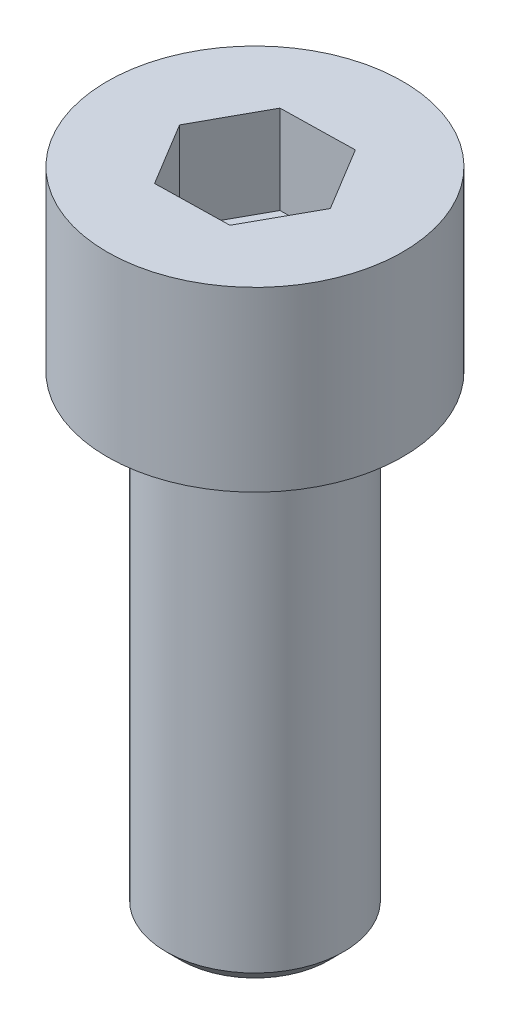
ISO-10303-21;
HEADER;
FILE_DESCRIPTION(('STEP AP214'),'2;1');
FILE_NAME('part.step','',(''),(''),'','','');
FILE_SCHEMA(('AUTOMOTIVE_DESIGN { 1 0 10303 214 1 1 1 1 }'));
ENDSEC;
DATA;
#1=APPLICATION_CONTEXT('core data for automotive mechanical design processes');
#2=APPLICATION_PROTOCOL_DEFINITION('international standard','automotive_design',2000,#1);
#3=PRODUCT_CONTEXT('',#1,'mechanical');
#4=PRODUCT('Part','Part','',(#3));
#5=PRODUCT_RELATED_PRODUCT_CATEGORY('part','',(#4));
#6=PRODUCT_DEFINITION_FORMATION('','',#4);
#7=PRODUCT_DEFINITION_CONTEXT('part definition',#1,'design');
#8=PRODUCT_DEFINITION('design','',#6,#7);
#9=PRODUCT_DEFINITION_SHAPE('','',#8);
#10=(LENGTH_UNIT() NAMED_UNIT(*) SI_UNIT(.MILLI.,.METRE.));
#11=(NAMED_UNIT(*) PLANE_ANGLE_UNIT() SI_UNIT($,.RADIAN.));
#12=(NAMED_UNIT(*) SI_UNIT($,.STERADIAN.) SOLID_ANGLE_UNIT());
#13=UNCERTAINTY_MEASURE_WITH_UNIT(LENGTH_MEASURE(1.E-05),#10,'distance_accuracy_value','');
#14=(GEOMETRIC_REPRESENTATION_CONTEXT(3) GLOBAL_UNCERTAINTY_ASSIGNED_CONTEXT((#13)) GLOBAL_UNIT_ASSIGNED_CONTEXT((#10,
#11,#12)) REPRESENTATION_CONTEXT('',''));
#15=CARTESIAN_POINT('',(0.,0.,0.));
#16=DIRECTION('',(0.,0.,1.));
#17=DIRECTION('',(1.,0.,0.));
#18=AXIS2_PLACEMENT_3D('',#15,#16,#17);
#19=CARTESIAN_POINT('',(0.,7.54618173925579,0.));
#20=DIRECTION('',(0.,1.,0.));
#21=DIRECTION('',(0.,0.,1.));
#22=AXIS2_PLACEMENT_3D('',#19,#20,#21);
#23=CYLINDRICAL_SURFACE('',#22,3.00000000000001);
#24=CARTESIAN_POINT('',(0.,0.,0.));
#25=DIRECTION('',(0.,1.,0.));
#26=DIRECTION('',(0.,0.,1.));
#27=AXIS2_PLACEMENT_3D('',#24,#25,#26);
#28=CIRCLE('',#27,3.00000000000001);
#29=CARTESIAN_POINT('',(0.,0.,3.00000000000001));
#30=VERTEX_POINT('',#29);
#31=EDGE_CURVE('E128',#30,#30,#28,.T.);
#32=CARTESIAN_POINT('',(0.,-15.5,0.));
#33=DIRECTION('',(0.,1.,0.));
#34=DIRECTION('',(0.,0.,1.));
#35=AXIS2_PLACEMENT_3D('',#32,#33,#34);
#36=CIRCLE('',#35,3.00000000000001);
#37=CARTESIAN_POINT('',(0.,-15.5,3.00000000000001));
#38=VERTEX_POINT('',#37);
#39=EDGE_CURVE('E11',#38,#38,#36,.T.);
#40=CARTESIAN_POINT('',(0.,0.,3.00000000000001));
#41=CARTESIAN_POINT('',(0.,-0.161458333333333,3.00000000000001));
#42=CARTESIAN_POINT('',(0.,-0.322916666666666,3.00000000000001));
#43=CARTESIAN_POINT('',(0.,-0.645833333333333,3.00000000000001));
#44=CARTESIAN_POINT('',(0.,-0.807291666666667,3.00000000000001));
#45=CARTESIAN_POINT('',(0.,-1.13020833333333,3.00000000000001));
#46=CARTESIAN_POINT('',(0.,-1.29166666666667,3.00000000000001));
#47=CARTESIAN_POINT('',(0.,-1.61458333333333,3.00000000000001));
#48=CARTESIAN_POINT('',(0.,-1.77604166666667,3.00000000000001));
#49=CARTESIAN_POINT('',(0.,-2.09895833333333,3.00000000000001));
#50=CARTESIAN_POINT('',(0.,-2.26041666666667,3.00000000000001));
#51=CARTESIAN_POINT('',(0.,-2.58333333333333,3.00000000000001));
#52=CARTESIAN_POINT('',(0.,-2.74479166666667,3.00000000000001));
#53=CARTESIAN_POINT('',(0.,-3.06770833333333,3.00000000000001));
#54=CARTESIAN_POINT('',(0.,-3.22916666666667,3.00000000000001));
#55=CARTESIAN_POINT('',(0.,-3.55208333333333,3.00000000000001));
#56=CARTESIAN_POINT('',(0.,-3.71354166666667,3.00000000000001));
#57=CARTESIAN_POINT('',(0.,-4.03645833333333,3.00000000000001));
#58=CARTESIAN_POINT('',(0.,-4.19791666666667,3.00000000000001));
#59=CARTESIAN_POINT('',(0.,-4.52083333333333,3.00000000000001));
#60=CARTESIAN_POINT('',(0.,-4.68229166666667,3.00000000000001));
#61=CARTESIAN_POINT('',(0.,-5.00520833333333,3.00000000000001));
#62=CARTESIAN_POINT('',(0.,-5.16666666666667,3.00000000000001));
#63=CARTESIAN_POINT('',(0.,-5.48958333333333,3.00000000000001));
#64=CARTESIAN_POINT('',(0.,-5.65104166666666,3.00000000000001));
#65=CARTESIAN_POINT('',(0.,-5.97395833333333,3.00000000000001));
#66=CARTESIAN_POINT('',(0.,-6.13541666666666,3.00000000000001));
#67=CARTESIAN_POINT('',(0.,-6.45833333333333,3.00000000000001));
#68=CARTESIAN_POINT('',(0.,-6.61979166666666,3.00000000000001));
#69=CARTESIAN_POINT('',(0.,-6.94270833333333,3.00000000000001));
#70=CARTESIAN_POINT('',(0.,-7.10416666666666,3.00000000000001));
#71=CARTESIAN_POINT('',(0.,-7.42708333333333,3.00000000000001));
#72=CARTESIAN_POINT('',(0.,-7.58854166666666,3.00000000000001));
#73=CARTESIAN_POINT('',(0.,-7.91145833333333,3.00000000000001));
#74=CARTESIAN_POINT('',(0.,-8.07291666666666,3.00000000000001));
#75=CARTESIAN_POINT('',(0.,-8.39583333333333,3.00000000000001));
#76=CARTESIAN_POINT('',(0.,-8.55729166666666,3.00000000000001));
#77=CARTESIAN_POINT('',(0.,-8.88020833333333,3.00000000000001));
#78=CARTESIAN_POINT('',(0.,-9.04166666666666,3.00000000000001));
#79=CARTESIAN_POINT('',(0.,-9.36458333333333,3.00000000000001));
#80=CARTESIAN_POINT('',(0.,-9.52604166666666,3.00000000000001));
#81=CARTESIAN_POINT('',(0.,-9.84895833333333,3.00000000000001));
#82=CARTESIAN_POINT('',(0.,-10.0104166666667,3.00000000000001));
#83=CARTESIAN_POINT('',(0.,-10.3333333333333,3.00000000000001));
#84=CARTESIAN_POINT('',(0.,-10.4947916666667,3.00000000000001));
#85=CARTESIAN_POINT('',(0.,-10.8177083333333,3.00000000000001));
#86=CARTESIAN_POINT('',(0.,-10.9791666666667,3.00000000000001));
#87=CARTESIAN_POINT('',(0.,-11.3020833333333,3.00000000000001));
#88=CARTESIAN_POINT('',(0.,-11.4635416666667,3.00000000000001));
#89=CARTESIAN_POINT('',(0.,-11.7864583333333,3.00000000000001));
#90=CARTESIAN_POINT('',(0.,-11.9479166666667,3.00000000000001));
#91=CARTESIAN_POINT('',(0.,-12.2708333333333,3.00000000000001));
#92=CARTESIAN_POINT('',(0.,-12.4322916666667,3.00000000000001));
#93=CARTESIAN_POINT('',(0.,-12.7552083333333,3.00000000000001));
#94=CARTESIAN_POINT('',(0.,-12.9166666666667,3.00000000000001));
#95=CARTESIAN_POINT('',(0.,-13.2395833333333,3.00000000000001));
#96=CARTESIAN_POINT('',(0.,-13.4010416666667,3.00000000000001));
#97=CARTESIAN_POINT('',(0.,-13.7239583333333,3.00000000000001));
#98=CARTESIAN_POINT('',(0.,-13.8854166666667,3.00000000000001));
#99=CARTESIAN_POINT('',(0.,-14.2083333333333,3.00000000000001));
#100=CARTESIAN_POINT('',(0.,-14.3697916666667,3.00000000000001));
#101=CARTESIAN_POINT('',(0.,-14.6927083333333,3.00000000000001));
#102=CARTESIAN_POINT('',(0.,-14.8541666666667,3.00000000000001));
#103=CARTESIAN_POINT('',(0.,-15.1770833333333,3.00000000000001));
#104=CARTESIAN_POINT('',(0.,-15.3385416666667,3.00000000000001));
#105=CARTESIAN_POINT('',(0.,-15.5,3.00000000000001));
#106=B_SPLINE_CURVE_WITH_KNOTS('',3,(#40,#41,#42,#43,#44,#45,#46,#47,#48,#49,#50,#51,#52,#53,
#54,#55,#56,#57,#58,#59,#60,#61,#62,#63,#64,#65,#66,#67,#68,#69,#70,#71,#72,#73,#74,#75,#76,#77,
#78,#79,#80,#81,#82,#83,#84,#85,#86,#87,#88,#89,#90,#91,#92,#93,#94,#95,#96,#97,#98,#99,#100,
#101,#102,#103,#104,#105),.UNSPECIFIED.,.F.,.F.,(4,2,2,2,2,2,2,2,2,2,2,2,2,2,2,2,2,2,2,2,2,2,2,
2,2,2,2,2,2,2,2,2,4),(0.,0.484375,0.96875,1.453125,1.9375,2.421875,2.90625,3.390625,3.875,
4.359375,4.84375,5.328125,5.8125,6.296875,6.78125,7.265625,7.75,8.234375,8.71875,9.203125,
9.6875,10.171875,10.65625,11.140625,11.625,12.109375,12.59375,13.078125,13.5625,14.046875,
14.53125,15.015625,15.5),.UNSPECIFIED.);
#107=EDGE_CURVE('BSEAM26',#30,#38,#106,.T.);
#108=ORIENTED_EDGE('',*,*,#31,.F.);
#109=ORIENTED_EDGE('',*,*,#39,.T.);
#110=ORIENTED_EDGE('',*,*,#107,.T.);
#111=ORIENTED_EDGE('',*,*,#107,.F.);
#112=EDGE_LOOP('',(#108,#110,#109,#111));
#113=FACE_BOUND('',#112,.T.);
#114=ADVANCED_FACE('F26',(#113),#23,.T.);
#115=CARTESIAN_POINT('',(0.,-16.,0.));
#116=DIRECTION('',(0.,1.,0.));
#117=DIRECTION('',(0.,0.,1.));
#118=AXIS2_PLACEMENT_3D('',#115,#116,#117);
#119=CONICAL_SURFACE('',#118,2.50000000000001,0.785398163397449);
#120=CARTESIAN_POINT('',(0.,-16.,0.));
#121=DIRECTION('',(0.,1.,0.));
#122=DIRECTION('',(0.,0.,1.));
#123=AXIS2_PLACEMENT_3D('',#120,#121,#122);
#124=CIRCLE('',#123,2.50000000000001);
#125=CARTESIAN_POINT('',(0.,-16.,2.5));
#126=VERTEX_POINT('',#125);
#127=EDGE_CURVE('E33',#126,#126,#124,.T.);
#128=CARTESIAN_POINT('',(0.,-15.5,3.));
#129=CARTESIAN_POINT('',(0.,-15.5052083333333,2.99479166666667));
#130=CARTESIAN_POINT('',(0.,-15.5104166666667,2.98958333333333));
#131=CARTESIAN_POINT('',(0.,-15.5208333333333,2.97916666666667));
#132=CARTESIAN_POINT('',(0.,-15.5260416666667,2.97395833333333));
#133=CARTESIAN_POINT('',(0.,-15.5364583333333,2.96354166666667));
#134=CARTESIAN_POINT('',(0.,-15.5416666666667,2.95833333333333));
#135=CARTESIAN_POINT('',(0.,-15.5520833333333,2.94791666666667));
#136=CARTESIAN_POINT('',(0.,-15.5572916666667,2.94270833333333));
#137=CARTESIAN_POINT('',(0.,-15.5677083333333,2.93229166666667));
#138=CARTESIAN_POINT('',(0.,-15.5729166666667,2.92708333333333));
#139=CARTESIAN_POINT('',(0.,-15.5833333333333,2.91666666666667));
#140=CARTESIAN_POINT('',(0.,-15.5885416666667,2.91145833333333));
#141=CARTESIAN_POINT('',(0.,-15.5989583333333,2.90104166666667));
#142=CARTESIAN_POINT('',(0.,-15.6041666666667,2.89583333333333));
#143=CARTESIAN_POINT('',(0.,-15.6145833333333,2.88541666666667));
#144=CARTESIAN_POINT('',(0.,-15.6197916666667,2.88020833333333));
#145=CARTESIAN_POINT('',(0.,-15.6302083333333,2.86979166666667));
#146=CARTESIAN_POINT('',(0.,-15.6354166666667,2.86458333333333));
#147=CARTESIAN_POINT('',(0.,-15.6458333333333,2.85416666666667));
#148=CARTESIAN_POINT('',(0.,-15.6510416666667,2.84895833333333));
#149=CARTESIAN_POINT('',(0.,-15.6614583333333,2.83854166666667));
#150=CARTESIAN_POINT('',(0.,-15.6666666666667,2.83333333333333));
#151=CARTESIAN_POINT('',(0.,-15.6770833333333,2.82291666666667));
#152=CARTESIAN_POINT('',(0.,-15.6822916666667,2.81770833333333));
#153=CARTESIAN_POINT('',(0.,-15.6927083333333,2.80729166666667));
#154=CARTESIAN_POINT('',(0.,-15.6979166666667,2.80208333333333));
#155=CARTESIAN_POINT('',(0.,-15.7083333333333,2.79166666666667));
#156=CARTESIAN_POINT('',(0.,-15.7135416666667,2.78645833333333));
#157=CARTESIAN_POINT('',(0.,-15.7239583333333,2.77604166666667));
#158=CARTESIAN_POINT('',(0.,-15.7291666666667,2.77083333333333));
#159=CARTESIAN_POINT('',(0.,-15.7395833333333,2.76041666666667));
#160=CARTESIAN_POINT('',(0.,-15.7447916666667,2.75520833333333));
#161=CARTESIAN_POINT('',(0.,-15.7552083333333,2.74479166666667));
#162=CARTESIAN_POINT('',(0.,-15.7604166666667,2.73958333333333));
#163=CARTESIAN_POINT('',(0.,-15.7708333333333,2.72916666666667));
#164=CARTESIAN_POINT('',(0.,-15.7760416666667,2.72395833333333));
#165=CARTESIAN_POINT('',(0.,-15.7864583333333,2.71354166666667));
#166=CARTESIAN_POINT('',(0.,-15.7916666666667,2.70833333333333));
#167=CARTESIAN_POINT('',(0.,-15.8020833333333,2.69791666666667));
#168=CARTESIAN_POINT('',(0.,-15.8072916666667,2.69270833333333));
#169=CARTESIAN_POINT('',(0.,-15.8177083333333,2.68229166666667));
#170=CARTESIAN_POINT('',(0.,-15.8229166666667,2.67708333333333));
#171=CARTESIAN_POINT('',(0.,-15.8333333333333,2.66666666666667));
#172=CARTESIAN_POINT('',(0.,-15.8385416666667,2.66145833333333));
#173=CARTESIAN_POINT('',(0.,-15.8489583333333,2.65104166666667));
#174=CARTESIAN_POINT('',(0.,-15.8541666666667,2.64583333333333));
#175=CARTESIAN_POINT('',(0.,-15.8645833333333,2.63541666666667));
#176=CARTESIAN_POINT('',(0.,-15.8697916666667,2.63020833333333));
#177=CARTESIAN_POINT('',(0.,-15.8802083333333,2.61979166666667));
#178=CARTESIAN_POINT('',(0.,-15.8854166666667,2.61458333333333));
#179=CARTESIAN_POINT('',(0.,-15.8958333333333,2.60416666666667));
#180=CARTESIAN_POINT('',(0.,-15.9010416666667,2.59895833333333));
#181=CARTESIAN_POINT('',(0.,-15.9114583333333,2.58854166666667));
#182=CARTESIAN_POINT('',(0.,-15.9166666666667,2.58333333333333));
#183=CARTESIAN_POINT('',(0.,-15.9270833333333,2.57291666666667));
#184=CARTESIAN_POINT('',(0.,-15.9322916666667,2.56770833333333));
#185=CARTESIAN_POINT('',(0.,-15.9427083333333,2.55729166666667));
#186=CARTESIAN_POINT('',(0.,-15.9479166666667,2.55208333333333));
#187=CARTESIAN_POINT('',(0.,-15.9583333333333,2.54166666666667));
#188=CARTESIAN_POINT('',(0.,-15.9635416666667,2.53645833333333));
#189=CARTESIAN_POINT('',(0.,-15.9739583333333,2.52604166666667));
#190=CARTESIAN_POINT('',(0.,-15.9791666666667,2.52083333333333));
#191=CARTESIAN_POINT('',(0.,-15.9895833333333,2.51041666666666));
#192=CARTESIAN_POINT('',(0.,-15.9947916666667,2.50520833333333));
#193=CARTESIAN_POINT('',(0.,-16.,2.5));
#194=B_SPLINE_CURVE_WITH_KNOTS('',3,(#128,#129,#130,#131,#132,#133,#134,#135,#136,#137,#138,
#139,#140,#141,#142,#143,#144,#145,#146,#147,#148,#149,#150,#151,#152,#153,#154,#155,#156,#157,
#158,#159,#160,#161,#162,#163,#164,#165,#166,#167,#168,#169,#170,#171,#172,#173,#174,#175,#176,
#177,#178,#179,#180,#181,#182,#183,#184,#185,#186,#187,#188,#189,#190,#191,#192,#193),
.UNSPECIFIED.,.F.,.F.,(4,2,2,2,2,2,2,2,2,2,2,2,2,2,2,2,2,2,2,2,2,2,2,2,2,2,2,2,2,2,2,2,4),(0.,
0.0220970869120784,0.044194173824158,0.0662912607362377,0.0883883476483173,0.110485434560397,
0.132582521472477,0.154679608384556,0.176776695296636,0.198873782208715,0.220970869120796,
0.243067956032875,0.265165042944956,0.287262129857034,0.309359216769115,0.331456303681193,
0.353553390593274,0.375650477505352,0.397747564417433,0.419844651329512,0.441941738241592,
0.464038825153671,0.486135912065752,0.50823299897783,0.530330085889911,0.552427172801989,
0.57452425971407,0.596621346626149,0.61871843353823,0.640815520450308,0.662912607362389,
0.685009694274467,0.707106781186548),.UNSPECIFIED.);
#195=EDGE_CURVE('BSEAM145',#38,#126,#194,.T.);
#196=ORIENTED_EDGE('',*,*,#39,.F.);
#197=ORIENTED_EDGE('',*,*,#127,.T.);
#198=ORIENTED_EDGE('',*,*,#195,.T.);
#199=ORIENTED_EDGE('',*,*,#195,.F.);
#200=EDGE_LOOP('',(#196,#198,#197,#199));
#201=FACE_BOUND('',#200,.T.);
#202=ADVANCED_FACE('F145',(#201),#119,.T.);
#203=CARTESIAN_POINT('',(0.,-16.,0.));
#204=DIRECTION('',(0.,1.,0.));
#205=DIRECTION('',(0.,0.,1.));
#206=AXIS2_PLACEMENT_3D('',#203,#204,#205);
#207=PLANE('',#206);
#208=ORIENTED_EDGE('',*,*,#127,.F.);
#209=EDGE_LOOP('',(#208));
#210=FACE_BOUND('',#209,.T.);
#211=ADVANCED_FACE('F147',(#210),#207,.F.);
#212=CARTESIAN_POINT('',(4.99999999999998,6.,0.));
#213=DIRECTION('',(0.,-1.,0.));
#214=DIRECTION('',(0.,0.,-1.));
#215=AXIS2_PLACEMENT_3D('',#212,#213,#214);
#216=PLANE('',#215);
#217=DIRECTION('',(0.517275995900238,0.,0.855818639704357));
#218=VECTOR('',#217,1.);
#219=CARTESIAN_POINT('',(-2.49949670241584,5.99999999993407,0.0501620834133));
#220=LINE('',#219,#218);
#221=CARTESIAN_POINT('',(-2.49949670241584,6.00000000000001,0.0501620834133));
#222=VERTEX_POINT('',#221);
#223=CARTESIAN_POINT('',(-1.20630671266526,5.99999999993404,2.18970868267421));
#224=VERTEX_POINT('',#223);
#225=EDGE_CURVE('E94',#222,#224,#220,.T.);
#226=ORIENTED_EDGE('',*,*,#225,.F.);
#227=DIRECTION('',(-0.482522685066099,0.,0.875883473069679));
#228=VECTOR('',#227,1.);
#229=CARTESIAN_POINT('',(-1.29318998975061,5.99999999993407,-2.13954659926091));
#230=LINE('',#229,#228);
#231=CARTESIAN_POINT('',(-1.29318998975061,5.99999999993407,-2.13954659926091));
#232=VERTEX_POINT('',#231);
#233=EDGE_CURVE('E40',#232,#222,#230,.T.);
#234=ORIENTED_EDGE('',*,*,#233,.F.);
#235=DIRECTION('',(-0.999798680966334,0.,0.0200648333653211));
#236=VECTOR('',#235,1.);
#237=CARTESIAN_POINT('',(1.20630671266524,5.99999999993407,-2.1897086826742));
#238=LINE('',#237,#236);
#239=CARTESIAN_POINT('',(1.20630671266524,5.99999999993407,-2.1897086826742));
#240=VERTEX_POINT('',#239);
#241=EDGE_CURVE('E110',#240,#232,#238,.T.);
#242=ORIENTED_EDGE('',*,*,#241,.F.);
#243=DIRECTION('',(-0.517275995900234,0.,-0.85581863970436));
#244=VECTOR('',#243,1.);
#245=CARTESIAN_POINT('',(2.49949670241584,5.99999999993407,-0.0501620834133));
#246=LINE('',#245,#244);
#247=CARTESIAN_POINT('',(2.49949670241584,5.99999999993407,-0.0501620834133));
#248=VERTEX_POINT('',#247);
#249=EDGE_CURVE('E104',#248,#240,#246,.T.);
#250=ORIENTED_EDGE('',*,*,#249,.F.);
#251=DIRECTION('',(0.482522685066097,0.,-0.875883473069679));
#252=VECTOR('',#251,1.);
#253=CARTESIAN_POINT('',(1.29318998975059,5.99999999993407,2.1395465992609));
#254=LINE('',#253,#252);
#255=CARTESIAN_POINT('',(1.29318998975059,5.99999999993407,2.1395465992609));
#256=VERTEX_POINT('',#255);
#257=EDGE_CURVE('E102',#256,#248,#254,.T.);
#258=ORIENTED_EDGE('',*,*,#257,.F.);
#259=DIRECTION('',(0.999798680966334,0.,-0.0200648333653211));
#260=VECTOR('',#259,1.);
#261=CARTESIAN_POINT('',(-1.20630671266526,5.99999999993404,2.18970868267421));
#262=LINE('',#261,#260);
#263=EDGE_CURVE('E83',#224,#256,#262,.T.);
#264=ORIENTED_EDGE('',*,*,#263,.F.);
#265=EDGE_LOOP('',(#226,#234,#242,#250,#258,#264));
#266=FACE_BOUND('',#265,.T.);
#267=CARTESIAN_POINT('',(0.,6.00000000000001,0.));
#268=DIRECTION('',(0.,1.,0.));
#269=DIRECTION('',(0.,0.,1.));
#270=AXIS2_PLACEMENT_3D('',#267,#268,#269);
#271=CIRCLE('',#270,5.);
#272=CARTESIAN_POINT('',(0.,6.00000000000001,5.));
#273=VERTEX_POINT('',#272);
#274=EDGE_CURVE('E140',#273,#273,#271,.T.);
#275=ORIENTED_EDGE('',*,*,#274,.T.);
#276=EDGE_LOOP('',(#275));
#277=FACE_BOUND('',#276,.T.);
#278=ADVANCED_FACE('F98',(#266,#277),#216,.F.);
#279=CARTESIAN_POINT('',(0.,7.54618173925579,0.));
#280=DIRECTION('',(0.,1.,0.));
#281=DIRECTION('',(0.,0.,1.));
#282=AXIS2_PLACEMENT_3D('',#279,#280,#281);
#283=CYLINDRICAL_SURFACE('',#282,5.);
#284=CARTESIAN_POINT('',(0.,0.,0.));
#285=DIRECTION('',(0.,1.,0.));
#286=DIRECTION('',(0.,0.,1.));
#287=AXIS2_PLACEMENT_3D('',#284,#285,#286);
#288=CIRCLE('',#287,5.);
#289=CARTESIAN_POINT('',(0.,0.,5.));
#290=VERTEX_POINT('',#289);
#291=EDGE_CURVE('E137',#290,#290,#288,.T.);
#292=CARTESIAN_POINT('',(0.,6.00000000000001,5.));
#293=CARTESIAN_POINT('',(0.,5.93750000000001,5.));
#294=CARTESIAN_POINT('',(0.,5.87500000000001,5.));
#295=CARTESIAN_POINT('',(0.,5.75000000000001,5.));
#296=CARTESIAN_POINT('',(0.,5.68750000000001,5.));
#297=CARTESIAN_POINT('',(0.,5.56250000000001,5.));
#298=CARTESIAN_POINT('',(0.,5.50000000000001,5.));
#299=CARTESIAN_POINT('',(0.,5.37500000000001,5.));
#300=CARTESIAN_POINT('',(0.,5.3125,5.));
#301=CARTESIAN_POINT('',(0.,5.1875,5.));
#302=CARTESIAN_POINT('',(0.,5.125,5.));
#303=CARTESIAN_POINT('',(0.,5.,5.));
#304=CARTESIAN_POINT('',(0.,4.9375,5.));
#305=CARTESIAN_POINT('',(0.,4.8125,5.));
#306=CARTESIAN_POINT('',(0.,4.75,5.));
#307=CARTESIAN_POINT('',(0.,4.625,5.));
#308=CARTESIAN_POINT('',(0.,4.5625,5.));
#309=CARTESIAN_POINT('',(0.,4.4375,5.));
#310=CARTESIAN_POINT('',(0.,4.375,5.));
#311=CARTESIAN_POINT('',(0.,4.25,5.));
#312=CARTESIAN_POINT('',(0.,4.1875,5.));
#313=CARTESIAN_POINT('',(0.,4.0625,5.));
#314=CARTESIAN_POINT('',(0.,4.,5.));
#315=CARTESIAN_POINT('',(0.,3.875,5.));
#316=CARTESIAN_POINT('',(0.,3.8125,5.));
#317=CARTESIAN_POINT('',(0.,3.6875,5.));
#318=CARTESIAN_POINT('',(0.,3.625,5.));
#319=CARTESIAN_POINT('',(0.,3.5,5.));
#320=CARTESIAN_POINT('',(0.,3.4375,5.));
#321=CARTESIAN_POINT('',(0.,3.3125,5.));
#322=CARTESIAN_POINT('',(0.,3.25,5.));
#323=CARTESIAN_POINT('',(0.,3.125,5.));
#324=CARTESIAN_POINT('',(0.,3.0625,5.));
#325=CARTESIAN_POINT('',(0.,2.9375,5.));
#326=CARTESIAN_POINT('',(0.,2.875,5.));
#327=CARTESIAN_POINT('',(0.,2.75,5.));
#328=CARTESIAN_POINT('',(0.,2.6875,5.));
#329=CARTESIAN_POINT('',(0.,2.5625,5.));
#330=CARTESIAN_POINT('',(0.,2.5,5.));
#331=CARTESIAN_POINT('',(0.,2.375,5.));
#332=CARTESIAN_POINT('',(0.,2.3125,5.));
#333=CARTESIAN_POINT('',(0.,2.1875,5.));
#334=CARTESIAN_POINT('',(0.,2.125,5.));
#335=CARTESIAN_POINT('',(0.,2.,5.));
#336=CARTESIAN_POINT('',(0.,1.9375,5.));
#337=CARTESIAN_POINT('',(0.,1.8125,5.));
#338=CARTESIAN_POINT('',(0.,1.75,5.));
#339=CARTESIAN_POINT('',(0.,1.625,5.));
#340=CARTESIAN_POINT('',(0.,1.5625,5.));
#341=CARTESIAN_POINT('',(0.,1.4375,5.));
#342=CARTESIAN_POINT('',(0.,1.375,5.));
#343=CARTESIAN_POINT('',(0.,1.25,5.));
#344=CARTESIAN_POINT('',(0.,1.1875,5.));
#345=CARTESIAN_POINT('',(0.,1.0625,5.));
#346=CARTESIAN_POINT('',(0.,1.,5.));
#347=CARTESIAN_POINT('',(0.,0.875000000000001,5.));
#348=CARTESIAN_POINT('',(0.,0.812500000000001,5.));
#349=CARTESIAN_POINT('',(0.,0.687500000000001,5.));
#350=CARTESIAN_POINT('',(0.,0.625000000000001,5.));
#351=CARTESIAN_POINT('',(0.,0.5,5.));
#352=CARTESIAN_POINT('',(0.,0.4375,5.));
#353=CARTESIAN_POINT('',(0.,0.3125,5.));
#354=CARTESIAN_POINT('',(0.,0.25,5.));
#355=CARTESIAN_POINT('',(0.,0.125,5.));
#356=CARTESIAN_POINT('',(0.,0.0625000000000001,5.));
#357=CARTESIAN_POINT('',(0.,0.,5.));
#358=B_SPLINE_CURVE_WITH_KNOTS('',3,(#292,#293,#294,#295,#296,#297,#298,#299,#300,#301,#302,
#303,#304,#305,#306,#307,#308,#309,#310,#311,#312,#313,#314,#315,#316,#317,#318,#319,#320,#321,
#322,#323,#324,#325,#326,#327,#328,#329,#330,#331,#332,#333,#334,#335,#336,#337,#338,#339,#340,
#341,#342,#343,#344,#345,#346,#347,#348,#349,#350,#351,#352,#353,#354,#355,#356,#357),
.UNSPECIFIED.,.F.,.F.,(4,2,2,2,2,2,2,2,2,2,2,2,2,2,2,2,2,2,2,2,2,2,2,2,2,2,2,2,2,2,2,2,4),(0.,
0.187499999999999,0.375,0.5625,0.750000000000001,0.937500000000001,1.125,1.3125,1.5,1.6875,
1.875,2.0625,2.25,2.4375,2.625,2.8125,3.,3.1875,3.375,3.5625,3.75,3.9375,4.125,4.3125,4.5,
4.6875,4.875,5.0625,5.25,5.4375,5.62500000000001,5.81250000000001,6.00000000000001),.UNSPECIFIED.);
#359=EDGE_CURVE('BSEAM154',#273,#290,#358,.T.);
#360=ORIENTED_EDGE('',*,*,#274,.F.);
#361=ORIENTED_EDGE('',*,*,#291,.T.);
#362=ORIENTED_EDGE('',*,*,#359,.T.);
#363=ORIENTED_EDGE('',*,*,#359,.F.);
#364=EDGE_LOOP('',(#360,#362,#361,#363));
#365=FACE_BOUND('',#364,.T.);
#366=ADVANCED_FACE('F154',(#365),#283,.T.);
#367=CARTESIAN_POINT('',(3.00000000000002,0.,0.));
#368=DIRECTION('',(0.,1.,0.));
#369=DIRECTION('',(0.,0.,1.));
#370=AXIS2_PLACEMENT_3D('',#367,#368,#369);
#371=PLANE('',#370);
#372=ORIENTED_EDGE('',*,*,#291,.F.);
#373=EDGE_LOOP('',(#372));
#374=FACE_BOUND('',#373,.T.);
#375=ORIENTED_EDGE('',*,*,#31,.T.);
#376=EDGE_LOOP('',(#375));
#377=FACE_BOUND('',#376,.T.);
#378=ADVANCED_FACE('F165',(#374,#377),#371,.F.);
#379=CARTESIAN_POINT('',(-1.29318998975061,2.99999999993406,-2.1395465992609));
#380=DIRECTION('',(-0.875883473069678,0.,-0.482522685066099));
#381=DIRECTION('',(-0.482522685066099,0.,0.875883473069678));
#382=AXIS2_PLACEMENT_3D('',#379,#380,#381);
#383=PLANE('',#382);
#384=ORIENTED_EDGE('',*,*,#233,.T.);
#385=DIRECTION('',(0.,1.,0.));
#386=VECTOR('',#385,1.);
#387=CARTESIAN_POINT('',(-2.49949670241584,2.99999999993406,0.0501620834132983));
#388=LINE('',#387,#386);
#389=CARTESIAN_POINT('',(-2.49949670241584,2.99999999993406,0.0501620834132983));
#390=VERTEX_POINT('',#389);
#391=EDGE_CURVE('E91',#390,#222,#388,.T.);
#392=ORIENTED_EDGE('',*,*,#391,.F.);
#393=DIRECTION('',(-0.482522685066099,0.,0.875883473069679));
#394=VECTOR('',#393,1.);
#395=CARTESIAN_POINT('',(-1.29318998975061,2.99999999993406,-2.1395465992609));
#396=LINE('',#395,#394);
#397=CARTESIAN_POINT('',(-1.29318998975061,2.99999999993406,-2.1395465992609));
#398=VERTEX_POINT('',#397);
#399=EDGE_CURVE('E112',#398,#390,#396,.T.);
#400=ORIENTED_EDGE('',*,*,#399,.F.);
#401=DIRECTION('',(0.,1.,0.));
#402=VECTOR('',#401,1.);
#403=CARTESIAN_POINT('',(-1.29318998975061,2.99999999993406,-2.1395465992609));
#404=LINE('',#403,#402);
#405=EDGE_CURVE('E47',#398,#232,#404,.T.);
#406=ORIENTED_EDGE('',*,*,#405,.T.);
#407=EDGE_LOOP('',(#384,#392,#400,#406));
#408=FACE_BOUND('',#407,.T.);
#409=ADVANCED_FACE('F167',(#408),#383,.F.);
#410=CARTESIAN_POINT('',(1.20630671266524,2.99999999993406,-2.18970868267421));
#411=DIRECTION('',(-0.0200648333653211,0.,-0.999798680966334));
#412=DIRECTION('',(-0.999798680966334,0.,0.0200648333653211));
#413=AXIS2_PLACEMENT_3D('',#410,#411,#412);
#414=PLANE('',#413);
#415=ORIENTED_EDGE('',*,*,#241,.T.);
#416=ORIENTED_EDGE('',*,*,#405,.F.);
#417=DIRECTION('',(-0.999798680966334,0.,0.0200648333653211));
#418=VECTOR('',#417,1.);
#419=CARTESIAN_POINT('',(1.20630671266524,2.99999999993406,-2.18970868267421));
#420=LINE('',#419,#418);
#421=CARTESIAN_POINT('',(1.20630671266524,2.99999999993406,-2.18970868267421));
#422=VERTEX_POINT('',#421);
#423=EDGE_CURVE('E124',#422,#398,#420,.T.);
#424=ORIENTED_EDGE('',*,*,#423,.F.);
#425=DIRECTION('',(0.,1.,0.));
#426=VECTOR('',#425,1.);
#427=CARTESIAN_POINT('',(1.20630671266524,2.99999999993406,-2.18970868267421));
#428=LINE('',#427,#426);
#429=EDGE_CURVE('E129',#422,#240,#428,.T.);
#430=ORIENTED_EDGE('',*,*,#429,.T.);
#431=EDGE_LOOP('',(#415,#416,#424,#430));
#432=FACE_BOUND('',#431,.T.);
#433=ADVANCED_FACE('F174',(#432),#414,.F.);
#434=CARTESIAN_POINT('',(2.49949670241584,2.99999999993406,-0.0501620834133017));
#435=DIRECTION('',(0.85581863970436,0.,-0.517275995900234));
#436=DIRECTION('',(-0.517275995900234,0.,-0.85581863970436));
#437=AXIS2_PLACEMENT_3D('',#434,#435,#436);
#438=PLANE('',#437);
#439=ORIENTED_EDGE('',*,*,#249,.T.);
#440=ORIENTED_EDGE('',*,*,#429,.F.);
#441=DIRECTION('',(-0.517275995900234,0.,-0.85581863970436));
#442=VECTOR('',#441,1.);
#443=CARTESIAN_POINT('',(2.49949670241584,2.99999999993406,-0.0501620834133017));
#444=LINE('',#443,#442);
#445=CARTESIAN_POINT('',(2.49949670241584,2.99999999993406,-0.0501620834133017));
#446=VERTEX_POINT('',#445);
#447=EDGE_CURVE('E121',#446,#422,#444,.T.);
#448=ORIENTED_EDGE('',*,*,#447,.F.);
#449=DIRECTION('',(0.,1.,0.));
#450=VECTOR('',#449,1.);
#451=CARTESIAN_POINT('',(2.49949670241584,2.99999999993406,-0.0501620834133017));
#452=LINE('',#451,#450);
#453=EDGE_CURVE('E131',#446,#248,#452,.T.);
#454=ORIENTED_EDGE('',*,*,#453,.T.);
#455=EDGE_LOOP('',(#439,#440,#448,#454));
#456=FACE_BOUND('',#455,.T.);
#457=ADVANCED_FACE('F188',(#456),#438,.F.);
#458=CARTESIAN_POINT('',(1.29318998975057,2.99999999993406,2.13954659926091));
#459=DIRECTION('',(0.875883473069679,0.,0.482522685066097));
#460=DIRECTION('',(0.482522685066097,0.,-0.875883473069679));
#461=AXIS2_PLACEMENT_3D('',#458,#459,#460);
#462=PLANE('',#461);
#463=ORIENTED_EDGE('',*,*,#257,.T.);
#464=ORIENTED_EDGE('',*,*,#453,.F.);
#465=DIRECTION('',(0.482522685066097,0.,-0.875883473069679));
#466=VECTOR('',#465,1.);
#467=CARTESIAN_POINT('',(1.29318998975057,2.99999999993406,2.13954659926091));
#468=LINE('',#467,#466);
#469=CARTESIAN_POINT('',(1.29318998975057,2.99999999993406,2.13954659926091));
#470=VERTEX_POINT('',#469);
#471=EDGE_CURVE('E118',#470,#446,#468,.T.);
#472=ORIENTED_EDGE('',*,*,#471,.F.);
#473=DIRECTION('',(0.,1.,0.));
#474=VECTOR('',#473,1.);
#475=CARTESIAN_POINT('',(1.29318998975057,2.99999999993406,2.13954659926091));
#476=LINE('',#475,#474);
#477=EDGE_CURVE('E90',#470,#256,#476,.T.);
#478=ORIENTED_EDGE('',*,*,#477,.T.);
#479=EDGE_LOOP('',(#463,#464,#472,#478));
#480=FACE_BOUND('',#479,.T.);
#481=ADVANCED_FACE('F185',(#480),#462,.F.);
#482=CARTESIAN_POINT('',(-1.20630671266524,2.99999999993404,2.1897086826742));
#483=DIRECTION('',(0.0200648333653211,0.,0.999798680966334));
#484=DIRECTION('',(0.999798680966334,0.,-0.0200648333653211));
#485=AXIS2_PLACEMENT_3D('',#482,#483,#484);
#486=PLANE('',#485);
#487=ORIENTED_EDGE('',*,*,#263,.T.);
#488=ORIENTED_EDGE('',*,*,#477,.F.);
#489=DIRECTION('',(0.999798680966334,0.,-0.0200648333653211));
#490=VECTOR('',#489,1.);
#491=CARTESIAN_POINT('',(-1.20630671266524,2.99999999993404,2.1897086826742));
#492=LINE('',#491,#490);
#493=CARTESIAN_POINT('',(-1.20630671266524,2.99999999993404,2.1897086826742));
#494=VERTEX_POINT('',#493);
#495=EDGE_CURVE('E86',#494,#470,#492,.T.);
#496=ORIENTED_EDGE('',*,*,#495,.F.);
#497=DIRECTION('',(0.,1.,0.));
#498=VECTOR('',#497,1.);
#499=CARTESIAN_POINT('',(-1.20630671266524,2.99999999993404,2.1897086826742));
#500=LINE('',#499,#498);
#501=EDGE_CURVE('E79',#494,#224,#500,.T.);
#502=ORIENTED_EDGE('',*,*,#501,.T.);
#503=EDGE_LOOP('',(#487,#488,#496,#502));
#504=FACE_BOUND('',#503,.T.);
#505=ADVANCED_FACE('F81',(#504),#486,.F.);
#506=CARTESIAN_POINT('',(-2.49949670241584,2.99999999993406,0.0501620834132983));
#507=DIRECTION('',(-0.855818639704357,0.,0.517275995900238));
#508=DIRECTION('',(0.517275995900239,0.,0.855818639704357));
#509=AXIS2_PLACEMENT_3D('',#506,#507,#508);
#510=PLANE('',#509);
#511=ORIENTED_EDGE('',*,*,#225,.T.);
#512=ORIENTED_EDGE('',*,*,#501,.F.);
#513=DIRECTION('',(0.517275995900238,0.,0.855818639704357));
#514=VECTOR('',#513,1.);
#515=CARTESIAN_POINT('',(-2.49949670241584,2.99999999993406,0.0501620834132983));
#516=LINE('',#515,#514);
#517=EDGE_CURVE('E115',#390,#494,#516,.T.);
#518=ORIENTED_EDGE('',*,*,#517,.F.);
#519=ORIENTED_EDGE('',*,*,#391,.T.);
#520=EDGE_LOOP('',(#511,#512,#518,#519));
#521=FACE_BOUND('',#520,.T.);
#522=ADVANCED_FACE('F95',(#521),#510,.F.);
#523=CARTESIAN_POINT('',(-2.49949670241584,2.99999999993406,0.0501620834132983));
#524=DIRECTION('',(0.,1.,0.));
#525=DIRECTION('',(0.,0.,1.));
#526=AXIS2_PLACEMENT_3D('',#523,#524,#525);
#527=PLANE('',#526);
#528=ORIENTED_EDGE('',*,*,#399,.T.);
#529=ORIENTED_EDGE('',*,*,#517,.T.);
#530=ORIENTED_EDGE('',*,*,#495,.T.);
#531=ORIENTED_EDGE('',*,*,#471,.T.);
#532=ORIENTED_EDGE('',*,*,#447,.T.);
#533=ORIENTED_EDGE('',*,*,#423,.T.);
#534=EDGE_LOOP('',(#528,#529,#530,#531,#532,#533));
#535=FACE_BOUND('',#534,.T.);
#536=ADVANCED_FACE('F182',(#535),#527,.T.);
#537=CLOSED_SHELL('',(#114,#202,#211,#278,#366,#378,#409,#433,#457,#481,#505,#522,#536));
#538=MANIFOLD_SOLID_BREP('B2',#537);
#539=ADVANCED_BREP_SHAPE_REPRESENTATION('',(#18,#538),#14);
#540=SHAPE_DEFINITION_REPRESENTATION(#9,#539);
ENDSEC;
END-ISO-10303-21;
